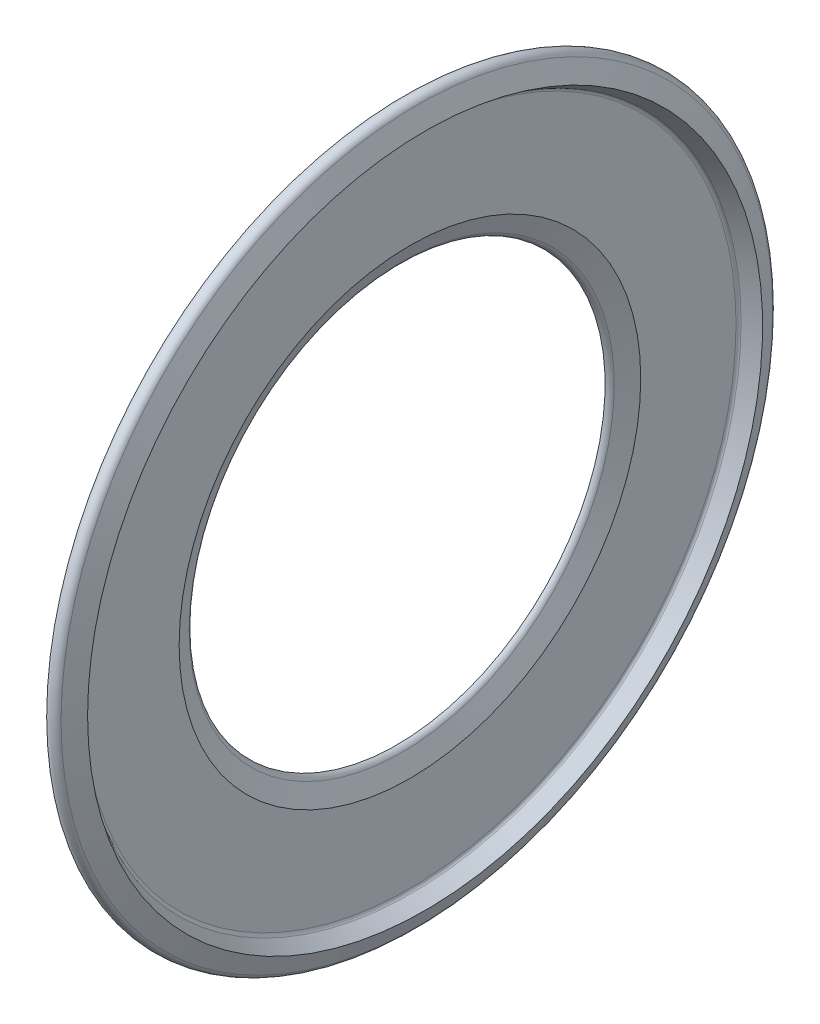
ISO-10303-21;
HEADER;
FILE_DESCRIPTION(('STEP AP214'),'2;1');
FILE_NAME('part.step','',(''),(''),'','','');
FILE_SCHEMA(('AUTOMOTIVE_DESIGN { 1 0 10303 214 1 1 1 1 }'));
ENDSEC;
DATA;
#1=APPLICATION_CONTEXT('core data for automotive mechanical design processes');
#2=APPLICATION_PROTOCOL_DEFINITION('international standard','automotive_design',2000,#1);
#3=PRODUCT_CONTEXT('',#1,'mechanical');
#4=PRODUCT('Part','Part','',(#3));
#5=PRODUCT_RELATED_PRODUCT_CATEGORY('part','',(#4));
#6=PRODUCT_DEFINITION_FORMATION('','',#4);
#7=PRODUCT_DEFINITION_CONTEXT('part definition',#1,'design');
#8=PRODUCT_DEFINITION('design','',#6,#7);
#9=PRODUCT_DEFINITION_SHAPE('','',#8);
#10=(LENGTH_UNIT() NAMED_UNIT(*) SI_UNIT(.MILLI.,.METRE.));
#11=(NAMED_UNIT(*) PLANE_ANGLE_UNIT() SI_UNIT($,.RADIAN.));
#12=(NAMED_UNIT(*) SI_UNIT($,.STERADIAN.) SOLID_ANGLE_UNIT());
#13=UNCERTAINTY_MEASURE_WITH_UNIT(LENGTH_MEASURE(1.E-05),#10,'distance_accuracy_value','');
#14=(GEOMETRIC_REPRESENTATION_CONTEXT(3) GLOBAL_UNCERTAINTY_ASSIGNED_CONTEXT((#13)) GLOBAL_UNIT_ASSIGNED_CONTEXT((#10,
#11,#12)) REPRESENTATION_CONTEXT('',''));
#15=CARTESIAN_POINT('',(0.,0.,0.));
#16=DIRECTION('',(0.,0.,1.));
#17=DIRECTION('',(1.,0.,0.));
#18=AXIS2_PLACEMENT_3D('',#15,#16,#17);
#19=CARTESIAN_POINT('',(0.6,0.,0.));
#20=DIRECTION('',(-1.,0.,0.));
#21=DIRECTION('',(0.,0.,1.));
#22=AXIS2_PLACEMENT_3D('',#19,#20,#21);
#23=TOROIDAL_SURFACE('',#22,9.305,0.2);
#24=CARTESIAN_POINT('',(0.481799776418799,0.,0.));
#25=DIRECTION('',(-1.,0.,0.));
#26=DIRECTION('',(0.,0.,1.));
#27=AXIS2_PLACEMENT_3D('',#24,#25,#26);
#28=CIRCLE('',#27,9.46633414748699);
#29=CARTESIAN_POINT('',(0.481799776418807,0.,9.46633414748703));
#30=VERTEX_POINT('',#29);
#31=EDGE_CURVE('E10',#30,#30,#28,.T.);
#32=ORIENTED_EDGE('',*,*,#31,.F.);
#33=EDGE_LOOP('',(#32));
#34=FACE_BOUND('',#33,.T.);
#35=CARTESIAN_POINT('',(0.782287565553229,0.,0.));
#36=DIRECTION('',(-1.,0.,0.));
#37=DIRECTION('',(0.,0.,1.));
#38=AXIS2_PLACEMENT_3D('',#35,#36,#37);
#39=CIRCLE('',#38,9.38728756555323);
#40=CARTESIAN_POINT('',(0.782287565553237,0.,9.38728756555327));
#41=VERTEX_POINT('',#40);
#42=EDGE_CURVE('E66',#41,#41,#39,.T.);
#43=ORIENTED_EDGE('',*,*,#42,.T.);
#44=EDGE_LOOP('',(#43));
#45=FACE_BOUND('',#44,.T.);
#46=ADVANCED_FACE('F29',(#34,#45),#23,.T.);
#47=CARTESIAN_POINT('',(0.481799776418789,9.46633414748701,0.));
#48=DIRECTION('',(1.,0.,0.));
#49=DIRECTION('',(0.,0.,-1.));
#50=AXIS2_PLACEMENT_3D('',#47,#48,#49);
#51=PLANE('',#50);
#52=CARTESIAN_POINT('',(0.481799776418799,0.,0.));
#53=DIRECTION('',(-1.,0.,0.));
#54=DIRECTION('',(0.,0.,1.));
#55=AXIS2_PLACEMENT_3D('',#52,#53,#54);
#56=CIRCLE('',#55,9.13039965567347);
#57=CARTESIAN_POINT('',(0.481799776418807,0.,9.13039965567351));
#58=VERTEX_POINT('',#57);
#59=EDGE_CURVE('E35',#58,#58,#56,.T.);
#60=ORIENTED_EDGE('',*,*,#59,.F.);
#61=EDGE_LOOP('',(#60));
#62=FACE_BOUND('',#61,.T.);
#63=ORIENTED_EDGE('',*,*,#31,.T.);
#64=EDGE_LOOP('',(#63));
#65=FACE_BOUND('',#64,.T.);
#66=ADVANCED_FACE('F121',(#62,#65),#51,.F.);
#67=CARTESIAN_POINT('',(0.481799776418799,0.,0.));
#68=DIRECTION('',(1.,0.,0.));
#69=DIRECTION('',(0.,0.,-1.));
#70=AXIS2_PLACEMENT_3D('',#67,#68,#69);
#71=CONICAL_SURFACE('',#70,9.13039965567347,0.785398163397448);
#72=CARTESIAN_POINT('',(0.398984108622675,0.,0.));
#73=DIRECTION('',(-1.,0.,0.));
#74=DIRECTION('',(0.,0.,1.));
#75=AXIS2_PLACEMENT_3D('',#72,#73,#74);
#76=CIRCLE('',#75,9.04758398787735);
#77=CARTESIAN_POINT('',(0.398984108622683,0.,9.04758398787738));
#78=VERTEX_POINT('',#77);
#79=EDGE_CURVE('E39',#78,#78,#76,.T.);
#80=ORIENTED_EDGE('',*,*,#79,.F.);
#81=EDGE_LOOP('',(#80));
#82=FACE_BOUND('',#81,.T.);
#83=ORIENTED_EDGE('',*,*,#59,.T.);
#84=EDGE_LOOP('',(#83));
#85=FACE_BOUND('',#84,.T.);
#86=ADVANCED_FACE('F116',(#82,#85),#71,.T.);
#87=CARTESIAN_POINT('',(0.752537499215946,0.,0.));
#88=DIRECTION('',(-1.,0.,0.));
#89=DIRECTION('',(0.,0.,1.));
#90=AXIS2_PLACEMENT_3D('',#87,#88,#89);
#91=TOROIDAL_SURFACE('',#90,8.69403059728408,0.499999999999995);
#92=CARTESIAN_POINT('',(0.25253749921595,0.,0.));
#93=DIRECTION('',(-1.,0.,0.));
#94=DIRECTION('',(0.,0.,1.));
#95=AXIS2_PLACEMENT_3D('',#92,#93,#94);
#96=CIRCLE('',#95,8.69403059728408);
#97=CARTESIAN_POINT('',(0.252537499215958,0.,8.69403059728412));
#98=VERTEX_POINT('',#97);
#99=EDGE_CURVE('E43',#98,#98,#96,.T.);
#100=ORIENTED_EDGE('',*,*,#99,.F.);
#101=EDGE_LOOP('',(#100));
#102=FACE_BOUND('',#101,.T.);
#103=ORIENTED_EDGE('',*,*,#79,.T.);
#104=EDGE_LOOP('',(#103));
#105=FACE_BOUND('',#104,.T.);
#106=ADVANCED_FACE('F110',(#102,#105),#91,.T.);
#107=CARTESIAN_POINT('',(0.252537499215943,8.6940305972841,0.));
#108=DIRECTION('',(1.,0.,0.));
#109=DIRECTION('',(0.,0.,-1.));
#110=AXIS2_PLACEMENT_3D('',#107,#108,#109);
#111=PLANE('',#110);
#112=CARTESIAN_POINT('',(0.252537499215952,0.,0.));
#113=DIRECTION('',(-1.,0.,0.));
#114=DIRECTION('',(0.,0.,1.));
#115=AXIS2_PLACEMENT_3D('',#112,#113,#114);
#116=CIRCLE('',#115,5.49702380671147);
#117=CARTESIAN_POINT('',(0.252537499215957,0.,5.49702380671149));
#118=VERTEX_POINT('',#117);
#119=EDGE_CURVE('E48',#118,#118,#116,.T.);
#120=ORIENTED_EDGE('',*,*,#119,.F.);
#121=EDGE_LOOP('',(#120));
#122=FACE_BOUND('',#121,.T.);
#123=ORIENTED_EDGE('',*,*,#99,.T.);
#124=EDGE_LOOP('',(#123));
#125=FACE_BOUND('',#124,.T.);
#126=ADVANCED_FACE('F104',(#122,#125),#111,.F.);
#127=CARTESIAN_POINT('',(0.199999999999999,0.,0.));
#128=DIRECTION('',(-1.,0.,0.));
#129=DIRECTION('',(0.,0.,1.));
#130=AXIS2_PLACEMENT_3D('',#127,#128,#129);
#131=TOROIDAL_SURFACE('',#130,5.69,0.2);
#132=CARTESIAN_POINT('',(0.38228756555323,0.,0.));
#133=DIRECTION('',(-1.,0.,0.));
#134=DIRECTION('',(0.,0.,1.));
#135=AXIS2_PLACEMENT_3D('',#132,#133,#134);
#136=CIRCLE('',#135,5.60771243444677);
#137=CARTESIAN_POINT('',(0.382287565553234,0.,5.6077124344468));
#138=VERTEX_POINT('',#137);
#139=EDGE_CURVE('E51',#138,#138,#136,.T.);
#140=ORIENTED_EDGE('',*,*,#139,.F.);
#141=EDGE_LOOP('',(#140));
#142=FACE_BOUND('',#141,.T.);
#143=ORIENTED_EDGE('',*,*,#119,.T.);
#144=EDGE_LOOP('',(#143));
#145=FACE_BOUND('',#144,.T.);
#146=ADVANCED_FACE('F98',(#142,#145),#131,.T.);
#147=CARTESIAN_POINT('',(0.38228756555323,0.,0.));
#148=DIRECTION('',(1.,0.,0.));
#149=DIRECTION('',(0.,0.,-1.));
#150=AXIS2_PLACEMENT_3D('',#147,#148,#149);
#151=CONICAL_SURFACE('',#150,5.60771243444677,1.14676528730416);
#152=CARTESIAN_POINT('',(0.6,0.,0.));
#153=DIRECTION('',(-1.,0.,0.));
#154=DIRECTION('',(0.,0.,1.));
#155=AXIS2_PLACEMENT_3D('',#152,#153,#154);
#156=CIRCLE('',#155,6.09);
#157=CARTESIAN_POINT('',(0.600000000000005,0.,6.09000000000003));
#158=VERTEX_POINT('',#157);
#159=EDGE_CURVE('E54',#158,#158,#156,.T.);
#160=ORIENTED_EDGE('',*,*,#159,.F.);
#161=EDGE_LOOP('',(#160));
#162=FACE_BOUND('',#161,.T.);
#163=ORIENTED_EDGE('',*,*,#139,.T.);
#164=EDGE_LOOP('',(#163));
#165=FACE_BOUND('',#164,.T.);
#166=ADVANCED_FACE('F92',(#162,#165),#151,.F.);
#167=CARTESIAN_POINT('',(0.59999999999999,6.09000000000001,0.));
#168=DIRECTION('',(-1.,0.,0.));
#169=DIRECTION('',(0.,0.,1.));
#170=AXIS2_PLACEMENT_3D('',#167,#168,#169);
#171=PLANE('',#170);
#172=CARTESIAN_POINT('',(0.600000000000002,0.,0.));
#173=DIRECTION('',(-1.,0.,0.));
#174=DIRECTION('',(0.,0.,1.));
#175=AXIS2_PLACEMENT_3D('',#172,#173,#174);
#176=CIRCLE('',#175,8.60354464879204);
#177=CARTESIAN_POINT('',(0.600000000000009,0.,8.60354464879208));
#178=VERTEX_POINT('',#177);
#179=EDGE_CURVE('E57',#178,#178,#176,.T.);
#180=ORIENTED_EDGE('',*,*,#179,.F.);
#181=EDGE_LOOP('',(#180));
#182=FACE_BOUND('',#181,.T.);
#183=ORIENTED_EDGE('',*,*,#159,.T.);
#184=EDGE_LOOP('',(#183));
#185=FACE_BOUND('',#184,.T.);
#186=ADVANCED_FACE('F86',(#182,#185),#171,.F.);
#187=CARTESIAN_POINT('',(0.699999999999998,0.,0.));
#188=DIRECTION('',(-1.,0.,0.));
#189=DIRECTION('',(0.,0.,1.));
#190=AXIS2_PLACEMENT_3D('',#187,#188,#189);
#191=TOROIDAL_SURFACE('',#190,8.60354464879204,0.0999999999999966);
#192=CARTESIAN_POINT('',(0.647691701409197,0.,0.));
#193=DIRECTION('',(-1.,0.,0.));
#194=DIRECTION('',(0.,0.,1.));
#195=AXIS2_PLACEMENT_3D('',#192,#193,#194);
#196=CIRCLE('',#195,8.68877282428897);
#197=CARTESIAN_POINT('',(0.647691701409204,0.,8.68877282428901));
#198=VERTEX_POINT('',#197);
#199=EDGE_CURVE('E60',#198,#198,#196,.T.);
#200=ORIENTED_EDGE('',*,*,#199,.F.);
#201=EDGE_LOOP('',(#200));
#202=FACE_BOUND('',#201,.T.);
#203=ORIENTED_EDGE('',*,*,#179,.T.);
#204=EDGE_LOOP('',(#203));
#205=FACE_BOUND('',#204,.T.);
#206=ADVANCED_FACE('F80',(#202,#205),#191,.F.);
#207=CARTESIAN_POINT('',(0.647691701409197,0.,0.));
#208=DIRECTION('',(1.,0.,0.));
#209=DIRECTION('',(0.,0.,-1.));
#210=AXIS2_PLACEMENT_3D('',#207,#208,#209);
#211=CONICAL_SURFACE('',#210,8.68877282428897,0.55046428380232);
#212=CARTESIAN_POINT('',(0.999999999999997,0.,0.));
#213=DIRECTION('',(-1.,0.,0.));
#214=DIRECTION('',(0.,0.,1.));
#215=AXIS2_PLACEMENT_3D('',#212,#213,#214);
#216=CIRCLE('',#215,8.905);
#217=CARTESIAN_POINT('',(1.00000000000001,0.,8.90500000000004));
#218=VERTEX_POINT('',#217);
#219=EDGE_CURVE('E63',#218,#218,#216,.T.);
#220=ORIENTED_EDGE('',*,*,#219,.F.);
#221=EDGE_LOOP('',(#220));
#222=FACE_BOUND('',#221,.T.);
#223=ORIENTED_EDGE('',*,*,#199,.T.);
#224=EDGE_LOOP('',(#223));
#225=FACE_BOUND('',#224,.T.);
#226=ADVANCED_FACE('F74',(#222,#225),#211,.F.);
#227=CARTESIAN_POINT('',(0.999999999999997,0.,0.));
#228=DIRECTION('',(-1.,0.,0.));
#229=DIRECTION('',(0.,0.,1.));
#230=AXIS2_PLACEMENT_3D('',#227,#228,#229);
#231=CONICAL_SURFACE('',#230,8.905,1.14676528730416);
#232=ORIENTED_EDGE('',*,*,#42,.F.);
#233=EDGE_LOOP('',(#232));
#234=FACE_BOUND('',#233,.T.);
#235=ORIENTED_EDGE('',*,*,#219,.T.);
#236=EDGE_LOOP('',(#235));
#237=FACE_BOUND('',#236,.T.);
#238=ADVANCED_FACE('F71',(#234,#237),#231,.T.);
#239=CLOSED_SHELL('',(#46,#66,#86,#106,#126,#146,#166,#186,#206,#226,#238));
#240=MANIFOLD_SOLID_BREP('B2',#239);
#241=ADVANCED_BREP_SHAPE_REPRESENTATION('',(#18,#240),#14);
#242=SHAPE_DEFINITION_REPRESENTATION(#9,#241);
ENDSEC;
END-ISO-10303-21;
